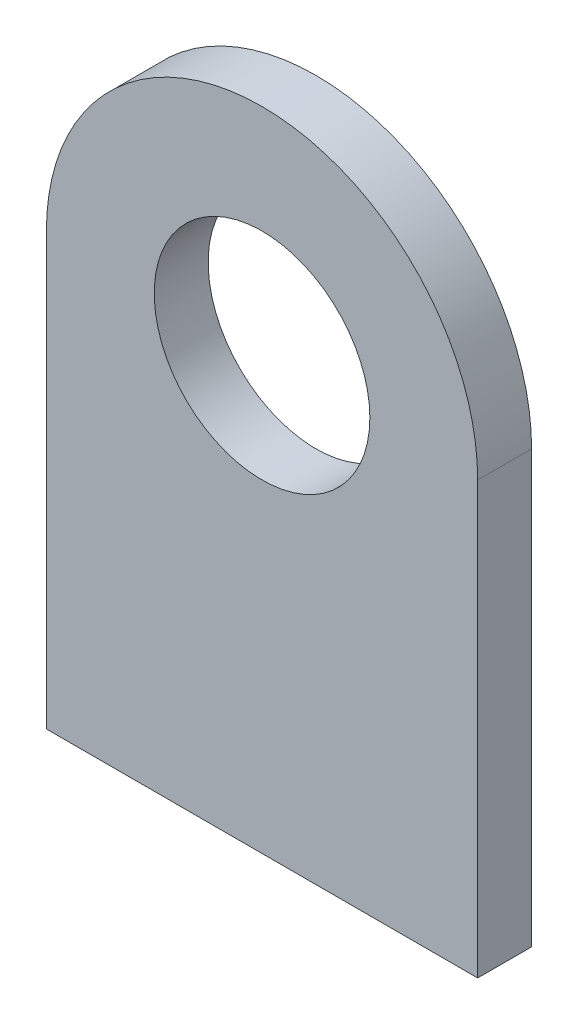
from build123d import *

# Parameters (mm, degrees)
EXTRUDE1_DEPTH     = 5
SKETCH2_R          = 10
CUT_EXTRUDE1_DEPTH = 73.284161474


with BuildPart() as part:
    # Sketch1 → Extrude1 (new body)
    with BuildSketch(Plane.XY):
        with BuildLine():
            Line((0, 40), (0, 0))
            Line((0, 0), (-40, 0))
            Line((-40, 0), (-40, 40))
            ThreePointArc((-40, 40), (-20, 60), (0, 40))
        make_face()
    extrude(amount=EXTRUDE1_DEPTH)

    # Sketch2 → Cut-Extrude1 (cut, through all)
    with BuildSketch(Plane.XY.offset(5)):
        with Locations((-20, 40)):
            Circle(SKETCH2_R)
    extrude(amount=-CUT_EXTRUDE1_DEPTH, mode=Mode.SUBTRACT)


solid = part.part
